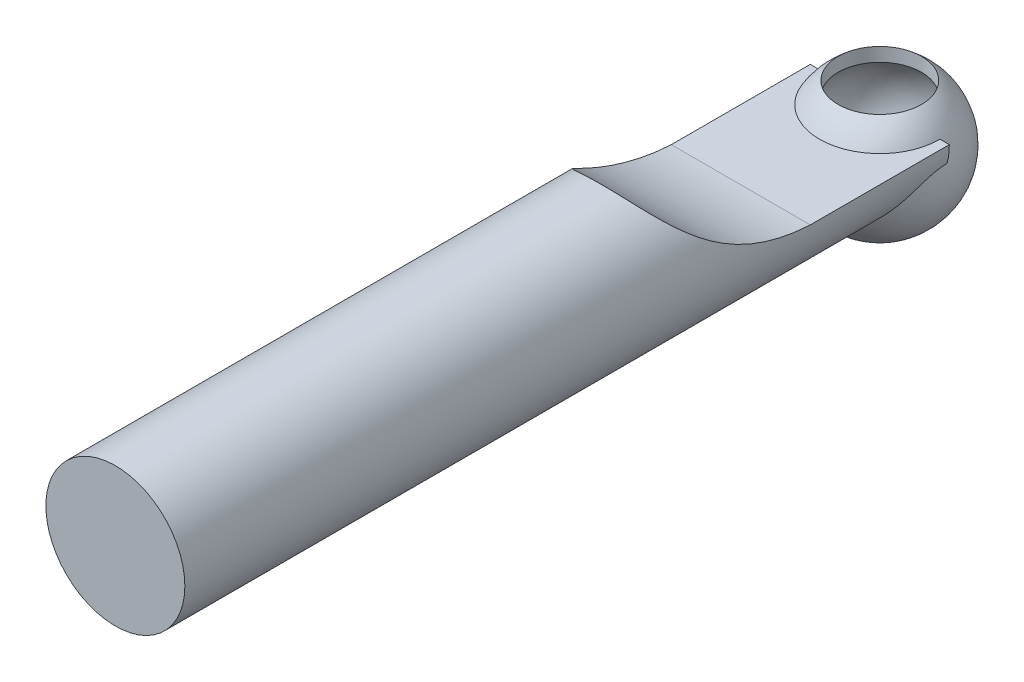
ISO-10303-21;
HEADER;
FILE_DESCRIPTION(('STEP AP214'),'2;1');
FILE_NAME('part.step','',(''),(''),'','','');
FILE_SCHEMA(('AUTOMOTIVE_DESIGN { 1 0 10303 214 1 1 1 1 }'));
ENDSEC;
DATA;
#1=APPLICATION_CONTEXT('core data for automotive mechanical design processes');
#2=APPLICATION_PROTOCOL_DEFINITION('international standard','automotive_design',2000,#1);
#3=PRODUCT_CONTEXT('',#1,'mechanical');
#4=PRODUCT('Part','Part','',(#3));
#5=PRODUCT_RELATED_PRODUCT_CATEGORY('part','',(#4));
#6=PRODUCT_DEFINITION_FORMATION('','',#4);
#7=PRODUCT_DEFINITION_CONTEXT('part definition',#1,'design');
#8=PRODUCT_DEFINITION('design','',#6,#7);
#9=PRODUCT_DEFINITION_SHAPE('','',#8);
#10=(LENGTH_UNIT() NAMED_UNIT(*) SI_UNIT(.MILLI.,.METRE.));
#11=(NAMED_UNIT(*) PLANE_ANGLE_UNIT() SI_UNIT($,.RADIAN.));
#12=(NAMED_UNIT(*) SI_UNIT($,.STERADIAN.) SOLID_ANGLE_UNIT());
#13=UNCERTAINTY_MEASURE_WITH_UNIT(LENGTH_MEASURE(1.E-05),#10,'distance_accuracy_value','');
#14=(GEOMETRIC_REPRESENTATION_CONTEXT(3) GLOBAL_UNCERTAINTY_ASSIGNED_CONTEXT((#13)) GLOBAL_UNIT_ASSIGNED_CONTEXT((#10,
#11,#12)) REPRESENTATION_CONTEXT('',''));
#15=CARTESIAN_POINT('',(0.,0.,0.));
#16=DIRECTION('',(0.,0.,1.));
#17=DIRECTION('',(1.,0.,0.));
#18=AXIS2_PLACEMENT_3D('',#15,#16,#17);
#19=CARTESIAN_POINT('',(0.,-55.,-60.));
#20=DIRECTION('',(0.,1.,0.));
#21=DIRECTION('',(0.,0.,1.));
#22=AXIS2_PLACEMENT_3D('',#19,#20,#21);
#23=CYLINDRICAL_SURFACE('',#22,6.00000000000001);
#24=CARTESIAN_POINT('',(0.,-13.,-60.));
#25=DIRECTION('',(0.,1.,0.));
#26=DIRECTION('',(0.,0.,1.));
#27=AXIS2_PLACEMENT_3D('',#24,#25,#26);
#28=CIRCLE('',#27,6.00000000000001);
#29=CARTESIAN_POINT('',(0.,-13.,-54.));
#30=VERTEX_POINT('',#29);
#31=EDGE_CURVE('E208',#30,#30,#28,.F.);
#32=ORIENTED_EDGE('',*,*,#31,.T.);
#33=EDGE_LOOP('',(#32));
#34=FACE_BOUND('',#33,.T.);
#35=CARTESIAN_POINT('',(0.,-11.0207972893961,-60.));
#36=DIRECTION('',(0.,1.,0.));
#37=DIRECTION('',(0.,0.,1.));
#38=AXIS2_PLACEMENT_3D('',#35,#36,#37);
#39=CIRCLE('',#38,6.00000000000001);
#40=CARTESIAN_POINT('',(0.,-11.0207972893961,-54.));
#41=VERTEX_POINT('',#40);
#42=EDGE_CURVE('E210',#41,#41,#39,.F.);
#43=ORIENTED_EDGE('',*,*,#42,.F.);
#44=EDGE_LOOP('',(#43));
#45=FACE_BOUND('',#44,.T.);
#46=ADVANCED_FACE('F39',(#34,#45),#23,.F.);
#47=CARTESIAN_POINT('',(0.,3.,-60.));
#48=DIRECTION('',(0.,-1.,0.));
#49=DIRECTION('',(0.,0.,-1.));
#50=AXIS2_PLACEMENT_3D('',#47,#48,#49);
#51=CIRCLE('',#50,6.00000000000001);
#52=CARTESIAN_POINT('',(0.,3.,-66.));
#53=VERTEX_POINT('',#52);
#54=EDGE_CURVE('E209',#53,#53,#51,.F.);
#55=ORIENTED_EDGE('',*,*,#54,.T.);
#56=EDGE_LOOP('',(#55));
#57=FACE_BOUND('',#56,.T.);
#58=CARTESIAN_POINT('',(0.,1.02079728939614,-60.));
#59=DIRECTION('',(0.,-1.,0.));
#60=DIRECTION('',(0.,0.,-1.));
#61=AXIS2_PLACEMENT_3D('',#58,#59,#60);
#62=CIRCLE('',#61,6.00000000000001);
#63=CARTESIAN_POINT('',(0.,1.02079728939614,-66.));
#64=VERTEX_POINT('',#63);
#65=EDGE_CURVE('E42',#64,#64,#62,.F.);
#66=ORIENTED_EDGE('',*,*,#65,.F.);
#67=EDGE_LOOP('',(#66));
#68=FACE_BOUND('',#67,.T.);
#69=ADVANCED_FACE('F128',(#57,#68),#23,.F.);
#70=CARTESIAN_POINT('',(0.,0.,-60.));
#71=DIRECTION('',(0.,0.,-1.));
#72=DIRECTION('',(-1.,0.,0.));
#73=AXIS2_PLACEMENT_3D('',#70,#71,#72);
#74=PLANE('',#73);
#75=CARTESIAN_POINT('',(0.,-5.,-60.));
#76=DIRECTION('',(0.,0.,-1.));
#77=DIRECTION('',(-1.,0.,0.));
#78=AXIS2_PLACEMENT_3D('',#75,#76,#77);
#79=CIRCLE('',#78,10.);
#80=CARTESIAN_POINT('',(-9.68245836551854,-2.5,-60.));
#81=VERTEX_POINT('',#80);
#82=CARTESIAN_POINT('',(-8.66025403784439,0.,-60.));
#83=VERTEX_POINT('',#82);
#84=EDGE_CURVE('E11',#81,#83,#79,.T.);
#85=ORIENTED_EDGE('',*,*,#84,.F.);
#86=CARTESIAN_POINT('',(0.,0.,-60.));
#87=DIRECTION('',(0.,0.,-1.));
#88=DIRECTION('',(-1.,0.,0.));
#89=AXIS2_PLACEMENT_3D('',#86,#87,#88);
#90=CIRCLE('',#89,10.);
#91=CARTESIAN_POINT('',(-10.,0.,-60.));
#92=VERTEX_POINT('',#91);
#93=EDGE_CURVE('E87',#81,#92,#90,.T.);
#94=ORIENTED_EDGE('',*,*,#93,.T.);
#95=DIRECTION('',(1.,0.,0.));
#96=VECTOR('',#95,1.);
#97=CARTESIAN_POINT('',(-10.,0.,-60.));
#98=LINE('',#97,#96);
#99=EDGE_CURVE('E151',#92,#83,#98,.T.);
#100=ORIENTED_EDGE('',*,*,#99,.T.);
#101=EDGE_LOOP('',(#85,#94,#100));
#102=FACE_BOUND('',#101,.T.);
#103=ADVANCED_FACE('F127',(#102),#74,.T.);
#104=CARTESIAN_POINT('',(0.,0.,50.));
#105=DIRECTION('',(0.,0.,-1.));
#106=DIRECTION('',(-1.,0.,0.));
#107=AXIS2_PLACEMENT_3D('',#104,#105,#106);
#108=CYLINDRICAL_SURFACE('',#107,10.);
#109=CARTESIAN_POINT('',(0.,0.,50.));
#110=DIRECTION('',(0.,0.,1.));
#111=DIRECTION('',(1.,0.,0.));
#112=AXIS2_PLACEMENT_3D('',#109,#110,#111);
#113=CIRCLE('',#112,10.);
#114=CARTESIAN_POINT('',(10.,0.,50.));
#115=VERTEX_POINT('',#114);
#116=EDGE_CURVE('E109',#115,#115,#113,.T.);
#117=ORIENTED_EDGE('',*,*,#116,.F.);
#118=EDGE_LOOP('',(#117));
#119=FACE_BOUND('',#118,.T.);
#120=ORIENTED_EDGE('',*,*,#93,.F.);
#121=CARTESIAN_POINT('',(-9.68245836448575,-2.500000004,-60.0002));
#122=CARTESIAN_POINT('',(-9.68245010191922,-2.49991985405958,-59.8515149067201));
#123=CARTESIAN_POINT('',(-9.68074927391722,-2.50661752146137,-59.7028662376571));
#124=CARTESIAN_POINT('',(-9.67389466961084,-2.53300126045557,-59.4069786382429));
#125=CARTESIAN_POINT('',(-9.6687450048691,-2.55267186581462,-59.2597382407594));
#126=CARTESIAN_POINT('',(-9.65500299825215,-2.60414539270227,-58.9692884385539));
#127=CARTESIAN_POINT('',(-9.64645005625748,-2.63580927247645,-58.826052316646));
#128=CARTESIAN_POINT('',(-9.62577377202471,-2.71034717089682,-58.5427637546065));
#129=CARTESIAN_POINT('',(-9.61364919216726,-2.7532250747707,-58.4027124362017));
#130=CARTESIAN_POINT('',(-9.58220511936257,-2.86098259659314,-58.0922447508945));
#131=CARTESIAN_POINT('',(-9.56184702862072,-2.92868145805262,-57.9229105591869));
#132=CARTESIAN_POINT('',(-9.51499190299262,-3.07750005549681,-57.5911524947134));
#133=CARTESIAN_POINT('',(-9.4884934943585,-3.15862279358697,-57.428730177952));
#134=CARTESIAN_POINT('',(-9.42887393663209,-3.33238711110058,-57.1104824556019));
#135=CARTESIAN_POINT('',(-9.39572304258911,-3.4250796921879,-56.9546906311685));
#136=CARTESIAN_POINT('',(-9.32253140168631,-3.61956015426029,-56.6505617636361));
#137=CARTESIAN_POINT('',(-9.28248851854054,-3.72135085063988,-56.5022270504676));
#138=CARTESIAN_POINT('',(-9.17807902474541,-3.97341472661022,-56.1562103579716));
#139=CARTESIAN_POINT('',(-9.11033152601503,-4.12704764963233,-55.9619861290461));
#140=CARTESIAN_POINT('',(-8.96016236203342,-4.44367289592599,-55.5873091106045));
#141=CARTESIAN_POINT('',(-8.87773534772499,-4.60666861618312,-55.4068613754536));
#142=CARTESIAN_POINT('',(-8.69770092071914,-4.93817501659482,-55.0591534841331));
#143=CARTESIAN_POINT('',(-8.6000951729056,-5.10668509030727,-54.8918918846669));
#144=CARTESIAN_POINT('',(-8.3893702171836,-5.44594802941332,-54.5699554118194));
#145=CARTESIAN_POINT('',(-8.27625262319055,-5.61670065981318,-54.4152792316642));
#146=CARTESIAN_POINT('',(-8.03145479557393,-5.96167157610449,-54.1144349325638));
#147=CARTESIAN_POINT('',(-7.89939581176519,-6.13587525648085,-53.9685581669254));
#148=CARTESIAN_POINT('',(-7.61889837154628,-6.48088128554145,-53.6890299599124));
#149=CARTESIAN_POINT('',(-7.47045952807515,-6.65168355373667,-53.5553788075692));
#150=CARTESIAN_POINT('',(-7.15749072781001,-6.98734395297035,-53.3000196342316));
#151=CARTESIAN_POINT('',(-6.99296233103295,-7.15220265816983,-53.1783104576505));
#152=CARTESIAN_POINT('',(-6.64829859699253,-7.47366484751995,-52.946627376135));
#153=CARTESIAN_POINT('',(-6.4681628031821,-7.6302680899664,-52.8366538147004));
#154=CARTESIAN_POINT('',(-6.0812465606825,-7.94254639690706,-52.6218080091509));
#155=CARTESIAN_POINT('',(-5.87350393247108,-8.09754899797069,-52.5176866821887));
#156=CARTESIAN_POINT('',(-5.44235019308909,-8.39340141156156,-52.3225307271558));
#157=CARTESIAN_POINT('',(-5.21893820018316,-8.53425042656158,-52.2314968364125));
#158=CARTESIAN_POINT('',(-4.75790536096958,-8.79960640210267,-52.0625445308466));
#159=CARTESIAN_POINT('',(-4.52028535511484,-8.92411432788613,-51.9846253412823));
#160=CARTESIAN_POINT('',(-4.03254833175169,-9.15485234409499,-51.841960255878));
#161=CARTESIAN_POINT('',(-3.78243229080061,-9.26108385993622,-51.7772133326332));
#162=CARTESIAN_POINT('',(-3.28834985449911,-9.44731947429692,-51.6647649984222));
#163=CARTESIAN_POINT('',(-3.04504775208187,-9.5285829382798,-51.6162268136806));
#164=CARTESIAN_POINT('',(-2.55102186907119,-9.67256298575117,-51.5307936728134));
#165=CARTESIAN_POINT('',(-2.30029837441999,-9.73528028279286,-51.4938982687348));
#166=CARTESIAN_POINT('',(-1.79342983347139,-9.84127174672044,-51.4318216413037));
#167=CARTESIAN_POINT('',(-1.5372864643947,-9.88455183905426,-51.406636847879));
#168=CARTESIAN_POINT('',(-1.02153712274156,-9.95108331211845,-51.3680125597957));
#169=CARTESIAN_POINT('',(-0.76193126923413,-9.97433537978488,-51.3545726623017));
#170=CARTESIAN_POINT('',(-0.255360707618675,-9.99978067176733,-51.3398698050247));
#171=CARTESIAN_POINT('',(-0.00846655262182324,-10.0030386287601,-51.3379911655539));
#172=CARTESIAN_POINT('',(0.484734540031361,-9.99128978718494,-51.3447755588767));
#173=CARTESIAN_POINT('',(0.731041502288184,-9.97628376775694,-51.3534381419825));
#174=CARTESIAN_POINT('',(1.22125200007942,-9.92820190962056,-51.3812870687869));
#175=CARTESIAN_POINT('',(1.46515582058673,-9.89512824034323,-51.4004721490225));
#176=CARTESIAN_POINT('',(1.94884505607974,-9.81133257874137,-51.4493320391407));
#177=CARTESIAN_POINT('',(2.18863044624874,-9.76061048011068,-51.4790069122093));
#178=CARTESIAN_POINT('',(2.66006064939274,-9.64274491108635,-51.5484532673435));
#179=CARTESIAN_POINT('',(2.89176251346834,-9.57576878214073,-51.5881220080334));
#180=CARTESIAN_POINT('',(3.34795397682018,-9.42596635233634,-51.6776405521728));
#181=CARTESIAN_POINT('',(3.57244367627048,-9.34314027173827,-51.7274902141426));
#182=CARTESIAN_POINT('',(4.01281240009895,-9.16263964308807,-51.8373158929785));
#183=CARTESIAN_POINT('',(4.22869115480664,-9.06496463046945,-51.8972922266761));
#184=CARTESIAN_POINT('',(4.65056403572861,-8.85594012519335,-52.0273199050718));
#185=CARTESIAN_POINT('',(4.85655791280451,-8.74459028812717,-52.0973715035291));
#186=CARTESIAN_POINT('',(5.26422137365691,-8.50562380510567,-52.2500156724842));
#187=CARTESIAN_POINT('',(5.46551843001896,-8.37758889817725,-52.3329482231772));
#188=CARTESIAN_POINT('',(5.85530813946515,-8.10994838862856,-52.5095207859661));
#189=CARTESIAN_POINT('',(6.04380054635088,-7.97034256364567,-52.6031610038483));
#190=CARTESIAN_POINT('',(6.40716603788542,-7.68128454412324,-52.8012046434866));
#191=CARTESIAN_POINT('',(6.58203560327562,-7.53182982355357,-52.9056108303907));
#192=CARTESIAN_POINT('',(6.91743561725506,-7.22500848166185,-53.1252529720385));
#193=CARTESIAN_POINT('',(7.07796574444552,-7.06764168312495,-53.2404891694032));
#194=CARTESIAN_POINT('',(7.39426571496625,-6.73651444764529,-53.4898768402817));
#195=CARTESIAN_POINT('',(7.54903214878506,-6.56235584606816,-53.6247732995));
#196=CARTESIAN_POINT('',(7.84142040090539,-6.21003509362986,-53.9073552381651));
#197=CARTESIAN_POINT('',(7.97904039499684,-6.03187251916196,-54.055042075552));
#198=CARTESIAN_POINT('',(8.23708158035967,-5.67442442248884,-54.3636825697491));
#199=CARTESIAN_POINT('',(8.35749589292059,-5.49513848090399,-54.5246414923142));
#200=CARTESIAN_POINT('',(8.58119115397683,-5.13881098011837,-54.8603225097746));
#201=CARTESIAN_POINT('',(8.68447541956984,-4.96176899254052,-55.0350419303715));
#202=CARTESIAN_POINT('',(8.85703270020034,-4.64535240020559,-55.36581592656));
#203=CARTESIAN_POINT('',(8.92907475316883,-4.50498533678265,-55.5194823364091));
#204=CARTESIAN_POINT('',(9.06228193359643,-4.23063625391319,-55.8368823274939));
#205=CARTESIAN_POINT('',(9.12344913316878,-4.09665302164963,-56.000613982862));
#206=CARTESIAN_POINT('',(9.23526744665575,-3.83792482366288,-56.3383445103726));
#207=CARTESIAN_POINT('',(9.28593137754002,-3.71316871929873,-56.5123305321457));
#208=CARTESIAN_POINT('',(9.37731633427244,-3.47593309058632,-56.8708699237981));
#209=CARTESIAN_POINT('',(9.41804143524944,-3.363448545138,-57.055418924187));
#210=CARTESIAN_POINT('',(9.50485548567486,-3.11157800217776,-57.5125916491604));
#211=CARTESIAN_POINT('',(9.54636847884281,-2.97990625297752,-57.7904623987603));
#212=CARTESIAN_POINT('',(9.61243751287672,-2.75944486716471,-58.3641473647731));
#213=CARTESIAN_POINT('',(9.63704617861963,-2.67052240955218,-58.6599027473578));
#214=CARTESIAN_POINT('',(9.66352351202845,-2.57246584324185,-59.1317650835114));
#215=CARTESIAN_POINT('',(9.67062754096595,-2.54545008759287,-59.3039509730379));
#216=CARTESIAN_POINT('',(9.6777294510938,-2.51826116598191,-59.5639370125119));
#217=CARTESIAN_POINT('',(9.67950437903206,-2.51142044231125,-59.651017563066));
#218=CARTESIAN_POINT('',(9.68186889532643,-2.50228327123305,-59.8254613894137));
#219=CARTESIAN_POINT('',(9.68245808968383,-2.49998833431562,-59.9128247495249));
#220=CARTESIAN_POINT('',(9.68245836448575,-2.500000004,-60.0002));
#221=B_SPLINE_CURVE_WITH_KNOTS('',3,(#121,#122,#123,#124,#125,#126,#127,#128,#129,#130,#131,
#132,#133,#134,#135,#136,#137,#138,#139,#140,#141,#142,#143,#144,#145,#146,#147,#148,#149,#150,
#151,#152,#153,#154,#155,#156,#157,#158,#159,#160,#161,#162,#163,#164,#165,#166,#167,#168,#169,
#170,#171,#172,#173,#174,#175,#176,#177,#178,#179,#180,#181,#182,#183,#184,#185,#186,#187,#188,
#189,#190,#191,#192,#193,#194,#195,#196,#197,#198,#199,#200,#201,#202,#203,#204,#205,#206,#207,
#208,#209,#210,#211,#212,#213,#214,#215,#216,#217,#218,#219,#220),.UNSPECIFIED.,.F.,.F.,(4,2,2,
2,2,2,2,2,2,2,2,2,2,2,2,2,2,2,2,2,2,2,2,2,2,2,2,2,2,2,2,2,2,2,2,2,2,2,2,2,2,2,2,2,2,2,2,2,2,4),
(0.,0.445835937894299,0.891141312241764,1.33143474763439,1.7718809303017,2.32154639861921,
2.87133496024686,3.42363885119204,3.97611424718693,4.74522743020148,5.51462144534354,
6.2839311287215,7.05316083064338,7.84075857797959,8.62837494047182,9.41591501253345,
10.2034781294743,11.0403683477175,11.8773056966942,12.7141935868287,13.5510161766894,
14.3332148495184,15.1153834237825,15.8973133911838,16.6792165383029,17.4190925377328,
18.1589369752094,18.8986925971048,19.6384526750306,20.370897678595,21.1033325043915,
21.8357902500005,22.5682664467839,23.3251383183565,24.0820247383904,24.8391060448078,
25.5962043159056,26.4029774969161,27.2098364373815,28.0170170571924,28.824041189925,
29.4842271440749,30.1442871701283,30.8035369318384,31.4625159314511,32.3900067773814,
33.3145970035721,33.8369648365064,34.0989484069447,34.3610190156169),.UNSPECIFIED.);
#222=CARTESIAN_POINT('',(9.68245836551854,-2.5,-60.));
#223=VERTEX_POINT('',#222);
#224=EDGE_CURVE('E93',#81,#223,#221,.T.);
#225=ORIENTED_EDGE('',*,*,#224,.T.);
#226=CARTESIAN_POINT('',(10.,0.,-60.));
#227=VERTEX_POINT('',#226);
#228=EDGE_CURVE('E79',#227,#223,#90,.T.);
#229=ORIENTED_EDGE('',*,*,#228,.F.);
#230=DIRECTION('',(0.,0.,-1.));
#231=VECTOR('',#230,1.);
#232=CARTESIAN_POINT('',(10.,0.,50.));
#233=LINE('',#232,#231);
#234=CARTESIAN_POINT('',(10.,0.,-40.));
#235=VERTEX_POINT('',#234);
#236=EDGE_CURVE('E100',#227,#235,#233,.F.);
#237=ORIENTED_EDGE('',*,*,#236,.T.);
#238=CARTESIAN_POINT('',(10.,0.,-40.));
#239=CARTESIAN_POINT('',(9.99995835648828,0.0198647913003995,-39.6123136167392));
#240=CARTESIAN_POINT('',(9.99993939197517,0.0478332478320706,-39.2250423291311));
#241=CARTESIAN_POINT('',(9.99935717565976,0.119907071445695,-38.4519962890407));
#242=CARTESIAN_POINT('',(9.99879391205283,0.164012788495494,-38.0662215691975));
#243=CARTESIAN_POINT('',(9.99653202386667,0.26835346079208,-37.2963825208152));
#244=CARTESIAN_POINT('',(9.99483201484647,0.32860803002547,-36.9123208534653));
#245=CARTESIAN_POINT('',(9.98941199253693,0.465111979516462,-36.1470677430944));
#246=CARTESIAN_POINT('',(9.98569200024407,0.541361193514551,-35.7658762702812));
#247=CARTESIAN_POINT('',(9.97508750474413,0.710550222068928,-35.0032823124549));
#248=CARTESIAN_POINT('',(9.96817194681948,0.80364824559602,-34.6219153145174));
#249=CARTESIAN_POINT('',(9.94980503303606,1.00582489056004,-33.8635530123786));
#250=CARTESIAN_POINT('',(9.93835374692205,1.11490326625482,-33.4865576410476));
#251=CARTESIAN_POINT('',(9.90933046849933,1.34871831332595,-32.7379633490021));
#252=CARTESIAN_POINT('',(9.89176264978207,1.47344427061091,-32.3663609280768));
#253=CARTESIAN_POINT('',(9.84867575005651,1.73826738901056,-31.6291874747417));
#254=CARTESIAN_POINT('',(9.82315758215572,1.87836278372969,-31.2636157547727));
#255=CARTESIAN_POINT('',(9.75511118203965,2.20729506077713,-30.4564808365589));
#256=CARTESIAN_POINT('',(9.71002658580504,2.399949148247,-30.0166737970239));
#257=CARTESIAN_POINT('',(9.60035652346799,2.80669124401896,-29.1495241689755));
#258=CARTESIAN_POINT('',(9.53577121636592,3.02077907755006,-28.7221814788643));
#259=CARTESIAN_POINT('',(9.38241747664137,3.46783689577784,-27.8839321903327));
#260=CARTESIAN_POINT('',(9.29373852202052,3.70073481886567,-27.4729711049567));
#261=CARTESIAN_POINT('',(9.08665437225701,4.18349989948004,-26.668877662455));
#262=CARTESIAN_POINT('',(8.96825911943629,4.43336136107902,-26.2757393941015));
#263=CARTESIAN_POINT('',(8.73434146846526,4.87387666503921,-25.6188075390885));
#264=CARTESIAN_POINT('',(8.62742757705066,5.06135274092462,-25.3498075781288));
#265=CARTESIAN_POINT('',(8.39308758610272,5.44112618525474,-24.8244687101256));
#266=CARTESIAN_POINT('',(8.26566692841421,5.63342226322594,-24.5681264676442));
#267=CARTESIAN_POINT('',(7.9883000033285,6.02027067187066,-24.0700363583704));
#268=CARTESIAN_POINT('',(7.83837131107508,6.2148211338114,-23.8282773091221));
#269=CARTESIAN_POINT('',(7.51405746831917,6.60324933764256,-23.3611501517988));
#270=CARTESIAN_POINT('',(7.33967837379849,6.79712723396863,-23.1357780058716));
#271=CARTESIAN_POINT('',(7.00635725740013,7.1382503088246,-22.751179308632));
#272=CARTESIAN_POINT('',(6.85247991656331,7.28635780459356,-22.5883200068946));
#273=CARTESIAN_POINT('',(6.52863883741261,7.57788320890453,-22.2748947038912));
#274=CARTESIAN_POINT('',(6.35867902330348,7.72130225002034,-22.1243257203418));
#275=CARTESIAN_POINT('',(6.00256865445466,8.00127883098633,-21.8364766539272));
#276=CARTESIAN_POINT('',(5.81641778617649,8.13783623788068,-21.6991968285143));
#277=CARTESIAN_POINT('',(5.4282329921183,8.40174745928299,-21.4389141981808));
#278=CARTESIAN_POINT('',(5.2261988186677,8.52910113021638,-21.3159116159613));
#279=CARTESIAN_POINT('',(4.80524329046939,8.77321585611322,-21.0841361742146));
#280=CARTESIAN_POINT('',(4.5861951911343,8.88987974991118,-20.9754904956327));
#281=CARTESIAN_POINT('',(4.13393347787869,9.10899121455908,-20.7744675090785));
#282=CARTESIAN_POINT('',(3.90071945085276,9.21143837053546,-20.6820906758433));
#283=CARTESIAN_POINT('',(3.42196106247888,9.39980420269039,-20.5143406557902));
#284=CARTESIAN_POINT('',(3.17642305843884,9.48573129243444,-20.4389588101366));
#285=CARTESIAN_POINT('',(2.67505674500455,9.63912646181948,-20.3056877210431));
#286=CARTESIAN_POINT('',(2.41923010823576,9.70659752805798,-20.2477956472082));
#287=CARTESIAN_POINT('',(1.93533884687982,9.81362384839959,-20.1565881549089));
#288=CARTESIAN_POINT('',(1.70826339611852,9.85573518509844,-20.1209941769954));
#289=CARTESIAN_POINT('',(1.2500731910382,9.92426088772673,-20.063292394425));
#290=CARTESIAN_POINT('',(1.01895884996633,9.95067684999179,-20.041183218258));
#291=CARTESIAN_POINT('',(0.554642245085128,9.98732153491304,-20.0105577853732));
#292=CARTESIAN_POINT('',(0.321440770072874,9.99755613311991,-20.0020365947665));
#293=CARTESIAN_POINT('',(-0.145205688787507,10.0016673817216,-19.9986104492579));
#294=CARTESIAN_POINT('',(-0.378650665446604,9.99554450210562,-20.0037051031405));
#295=CARTESIAN_POINT('',(-0.827807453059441,9.96804020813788,-20.0266653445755));
#296=CARTESIAN_POINT('',(-1.04363306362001,9.94773895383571,-20.0436270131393));
#297=CARTESIAN_POINT('',(-1.47228028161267,9.8933845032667,-20.0892627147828));
#298=CARTESIAN_POINT('',(-1.68510207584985,9.85933216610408,-20.1179360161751));
#299=CARTESIAN_POINT('',(-2.10625261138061,9.77802075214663,-20.1868701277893));
#300=CARTESIAN_POINT('',(-2.31458213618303,9.73076399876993,-20.2271288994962));
#301=CARTESIAN_POINT('',(-2.72543522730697,9.62377616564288,-20.3190634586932));
#302=CARTESIAN_POINT('',(-2.92795864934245,9.56404477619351,-20.3707395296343));
#303=CARTESIAN_POINT('',(-3.32825558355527,9.43226510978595,-20.4859346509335));
#304=CARTESIAN_POINT('',(-3.52594788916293,9.36008332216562,-20.5495828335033));
#305=CARTESIAN_POINT('',(-3.91303024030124,9.20498076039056,-20.6880187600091));
#306=CARTESIAN_POINT('',(-4.10242031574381,9.12206002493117,-20.7628064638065));
#307=CARTESIAN_POINT('',(-4.47198454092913,8.94668595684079,-20.9231545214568));
#308=CARTESIAN_POINT('',(-4.65215882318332,8.85423276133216,-21.0087147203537));
#309=CARTESIAN_POINT('',(-5.00264444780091,8.66103982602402,-21.1902130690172));
#310=CARTESIAN_POINT('',(-5.1729521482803,8.56029705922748,-21.2861550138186));
#311=CARTESIAN_POINT('',(-5.51676074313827,8.34326166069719,-21.4962449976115));
#312=CARTESIAN_POINT('',(-5.68936557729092,8.22637186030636,-21.6112420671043));
#313=CARTESIAN_POINT('',(-6.02202659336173,7.986070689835,-21.8521911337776));
#314=CARTESIAN_POINT('',(-6.18207776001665,7.86265674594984,-21.9781474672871));
#315=CARTESIAN_POINT('',(-6.48945211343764,7.61094434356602,-22.2402852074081));
#316=CARTESIAN_POINT('',(-6.63677473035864,7.48264566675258,-22.3764670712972));
#317=CARTESIAN_POINT('',(-6.91881472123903,7.22265931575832,-22.6583442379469));
#318=CARTESIAN_POINT('',(-7.05352934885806,7.09097091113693,-22.8040416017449));
#319=CARTESIAN_POINT('',(-7.37661406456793,6.75749250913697,-23.1812768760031));
#320=CARTESIAN_POINT('',(-7.55704883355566,6.55440274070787,-23.4185020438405));
#321=CARTESIAN_POINT('',(-7.89135372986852,6.14783557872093,-23.9106895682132));
#322=CARTESIAN_POINT('',(-8.0452127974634,5.94435805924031,-24.1656592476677));
#323=CARTESIAN_POINT('',(-8.32872840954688,5.5401554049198,-24.6914525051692));
#324=CARTESIAN_POINT('',(-8.45834718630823,5.33943500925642,-24.9622999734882));
#325=CARTESIAN_POINT('',(-8.69556264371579,4.94372489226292,-25.5175277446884));
#326=CARTESIAN_POINT('',(-8.80315211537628,4.74873706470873,-25.8019124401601));
#327=CARTESIAN_POINT('',(-9.04786415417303,4.27084608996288,-26.5279472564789));
#328=CARTESIAN_POINT('',(-9.17276174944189,3.99286145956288,-26.9769804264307));
#329=CARTESIAN_POINT('',(-9.3868808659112,3.45963248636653,-27.8965630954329));
#330=CARTESIAN_POINT('',(-9.47608377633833,3.20440006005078,-28.3671236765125));
#331=CARTESIAN_POINT('',(-9.62661353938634,2.71902428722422,-29.3274800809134));
#332=CARTESIAN_POINT('',(-9.68783448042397,2.48897872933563,-29.8173414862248));
#333=CARTESIAN_POINT('',(-9.78863404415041,2.05713761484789,-30.811417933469));
#334=CARTESIAN_POINT('',(-9.82821449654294,1.85533967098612,-31.3156317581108));
#335=CARTESIAN_POINT('',(-9.88024431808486,1.5477875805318,-32.1543904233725));
#336=CARTESIAN_POINT('',(-9.89733659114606,1.43339354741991,-32.4855282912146));
#337=CARTESIAN_POINT('',(-9.92625853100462,1.21709252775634,-33.1521113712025));
#338=CARTESIAN_POINT('',(-9.9380879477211,1.11518613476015,-33.4875567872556));
#339=CARTESIAN_POINT('',(-9.95767985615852,0.924035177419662,-34.1622625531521));
#340=CARTESIAN_POINT('',(-9.96544102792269,0.834794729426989,-34.5015241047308));
#341=CARTESIAN_POINT('',(-9.97793164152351,0.669162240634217,-35.1832253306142));
#342=CARTESIAN_POINT('',(-9.98266106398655,0.592770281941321,-35.5256650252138));
#343=CARTESIAN_POINT('',(-9.98994590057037,0.453638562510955,-36.2098422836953));
#344=CARTESIAN_POINT('',(-9.9925221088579,0.390772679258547,-36.5515540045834));
#345=CARTESIAN_POINT('',(-9.9962984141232,0.27784836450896,-37.2370955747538));
#346=CARTESIAN_POINT('',(-9.99749850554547,0.227789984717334,-37.5809254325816));
#347=CARTESIAN_POINT('',(-9.99910879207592,0.140580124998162,-38.2700033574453));
#348=CARTESIAN_POINT('',(-9.99951947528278,0.103420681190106,-38.6152504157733));
#349=CARTESIAN_POINT('',(-9.9999517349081,0.0420142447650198,-39.3068876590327));
#350=CARTESIAN_POINT('',(-9.99997331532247,0.0177671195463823,-39.6532778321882));
#351=CARTESIAN_POINT('',(-10.,0.,-40.));
#352=B_SPLINE_CURVE_WITH_KNOTS('',3,(#238,#239,#240,#241,#242,#243,#244,#245,#246,#247,#248,
#249,#250,#251,#252,#253,#254,#255,#256,#257,#258,#259,#260,#261,#262,#263,#264,#265,#266,#267,
#268,#269,#270,#271,#272,#273,#274,#275,#276,#277,#278,#279,#280,#281,#282,#283,#284,#285,#286,
#287,#288,#289,#290,#291,#292,#293,#294,#295,#296,#297,#298,#299,#300,#301,#302,#303,#304,#305,
#306,#307,#308,#309,#310,#311,#312,#313,#314,#315,#316,#317,#318,#319,#320,#321,#322,#323,#324,
#325,#326,#327,#328,#329,#330,#331,#332,#333,#334,#335,#336,#337,#338,#339,#340,#341,#342,#343,
#344,#345,#346,#347,#348,#349,#350,#351),.UNSPECIFIED.,.F.,.F.,(4,2,2,2,2,2,2,2,2,2,2,2,2,2,2,2,
2,2,2,2,2,2,2,2,2,2,2,2,2,2,2,2,2,2,2,2,2,2,2,2,2,2,2,2,2,2,2,2,2,2,2,2,2,2,2,2,4),(0.,
1.16450071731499,2.32902669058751,3.49497352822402,4.66090824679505,5.8384199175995,
7.01591348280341,8.19260515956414,9.3691617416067,10.8149857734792,12.2607980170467,
13.7013125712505,15.1413458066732,16.1752133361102,17.2088069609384,18.241597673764,
19.2741330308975,20.0791590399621,20.8839891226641,21.6888347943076,22.493693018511,
23.3052612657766,24.1168531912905,24.9280306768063,25.7390768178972,26.4391830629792,
27.1392180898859,27.8389988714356,28.5387595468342,29.1903162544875,29.8418322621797,
30.4932337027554,31.1446513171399,31.8035463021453,32.4624389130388,33.1213220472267,
33.7804468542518,34.4939585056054,35.2077537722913,35.9215809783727,36.6355633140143,
37.715884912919,38.796655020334,39.8790952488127,40.9618891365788,42.587383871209,
44.2137250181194,45.8461718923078,47.4784807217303,48.5304896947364,49.5825486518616,
50.6349487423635,51.687355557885,52.7294775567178,53.7716037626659,54.8130854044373,
55.8545563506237),.UNSPECIFIED.);
#353=CARTESIAN_POINT('',(-10.,0.,-40.));
#354=VERTEX_POINT('',#353);
#355=EDGE_CURVE('E105',#235,#354,#352,.T.);
#356=ORIENTED_EDGE('',*,*,#355,.T.);
#357=DIRECTION('',(0.,0.,-1.));
#358=VECTOR('',#357,1.);
#359=CARTESIAN_POINT('',(-10.,0.,50.));
#360=LINE('',#359,#358);
#361=EDGE_CURVE('E98',#354,#92,#360,.T.);
#362=ORIENTED_EDGE('',*,*,#361,.T.);
#363=EDGE_LOOP('',(#120,#225,#229,#237,#356,#362));
#364=FACE_BOUND('',#363,.T.);
#365=ADVANCED_FACE('F41',(#119,#364),#108,.T.);
#366=CARTESIAN_POINT('',(0.,0.,50.));
#367=DIRECTION('',(0.,0.,1.));
#368=DIRECTION('',(1.,0.,0.));
#369=AXIS2_PLACEMENT_3D('',#366,#367,#368);
#370=PLANE('',#369);
#371=ORIENTED_EDGE('',*,*,#116,.T.);
#372=EDGE_LOOP('',(#371));
#373=FACE_BOUND('',#372,.T.);
#374=ADVANCED_FACE('F118',(#373),#370,.T.);
#375=CARTESIAN_POINT('',(-50.,0.,-50.));
#376=DIRECTION('',(0.,-1.,0.));
#377=DIRECTION('',(0.,0.,-1.));
#378=AXIS2_PLACEMENT_3D('',#375,#376,#377);
#379=PLANE('',#378);
#380=CARTESIAN_POINT('',(8.66025403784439,0.,-60.));
#381=VERTEX_POINT('',#380);
#382=EDGE_CURVE('E81',#381,#227,#98,.T.);
#383=ORIENTED_EDGE('',*,*,#382,.F.);
#384=CARTESIAN_POINT('',(0.,0.,-60.));
#385=DIRECTION('',(0.,-1.,0.));
#386=DIRECTION('',(0.,0.,-1.));
#387=AXIS2_PLACEMENT_3D('',#384,#385,#386);
#388=CIRCLE('',#387,8.66025403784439);
#389=EDGE_CURVE('E65',#381,#83,#388,.T.);
#390=ORIENTED_EDGE('',*,*,#389,.T.);
#391=ORIENTED_EDGE('',*,*,#99,.F.);
#392=ORIENTED_EDGE('',*,*,#361,.F.);
#393=DIRECTION('',(1.,0.,0.));
#394=VECTOR('',#393,1.);
#395=CARTESIAN_POINT('',(-50.,0.,-40.));
#396=LINE('',#395,#394);
#397=EDGE_CURVE('E155',#354,#235,#396,.T.);
#398=ORIENTED_EDGE('',*,*,#397,.T.);
#399=ORIENTED_EDGE('',*,*,#236,.F.);
#400=EDGE_LOOP('',(#383,#390,#391,#392,#398,#399));
#401=FACE_BOUND('',#400,.T.);
#402=ADVANCED_FACE('F116',(#401),#379,.F.);
#403=CARTESIAN_POINT('',(-50.,27.8553095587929,-41.4276547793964));
#404=DIRECTION('',(1.,0.,0.));
#405=DIRECTION('',(0.,0.,-1.));
#406=AXIS2_PLACEMENT_3D('',#403,#404,#405);
#407=CYLINDRICAL_SURFACE('',#406,27.8918710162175);
#408=ORIENTED_EDGE('',*,*,#397,.F.);
#409=ORIENTED_EDGE('',*,*,#355,.F.);
#410=EDGE_LOOP('',(#408,#409));
#411=FACE_BOUND('',#410,.T.);
#412=ADVANCED_FACE('F115',(#411),#407,.F.);
#413=EDGE_CURVE('E47',#381,#223,#79,.T.);
#414=ORIENTED_EDGE('',*,*,#413,.F.);
#415=ORIENTED_EDGE('',*,*,#382,.T.);
#416=ORIENTED_EDGE('',*,*,#228,.T.);
#417=EDGE_LOOP('',(#414,#415,#416));
#418=FACE_BOUND('',#417,.T.);
#419=ADVANCED_FACE('F85',(#418),#74,.T.);
#420=CARTESIAN_POINT('',(0.,-5.,-60.));
#421=DIRECTION('',(0.,0.,1.));
#422=DIRECTION('',(-1.,0.,0.));
#423=AXIS2_PLACEMENT_3D('',#420,#421,#422);
#424=SPHERICAL_SURFACE('',#423,10.);
#425=ORIENTED_EDGE('',*,*,#224,.F.);
#426=ORIENTED_EDGE('',*,*,#84,.T.);
#427=ORIENTED_EDGE('',*,*,#389,.F.);
#428=ORIENTED_EDGE('',*,*,#413,.T.);
#429=EDGE_LOOP('',(#425,#426,#427,#428));
#430=FACE_BOUND('',#429,.T.);
#431=ORIENTED_EDGE('',*,*,#54,.F.);
#432=EDGE_LOOP('',(#431));
#433=FACE_BOUND('',#432,.T.);
#434=ORIENTED_EDGE('',*,*,#31,.F.);
#435=EDGE_LOOP('',(#434));
#436=FACE_BOUND('',#435,.T.);
#437=ADVANCED_FACE('F92',(#430,#433,#436),#424,.T.);
#438=CARTESIAN_POINT('',(0.,-5.,-60.));
#439=DIRECTION('',(0.,0.,-1.));
#440=DIRECTION('',(1.,0.,0.));
#441=AXIS2_PLACEMENT_3D('',#438,#439,#440);
#442=SPHERICAL_SURFACE('',#441,8.5);
#443=CARTESIAN_POINT('',(0.,-5.,-60.));
#444=DIRECTION('',(0.,-1.,0.));
#445=DIRECTION('',(0.,0.,-1.));
#446=AXIS2_PLACEMENT_3D('',#443,#444,#445);
#447=SPHERICAL_SURFACE('',#446,8.5);
#448=ORIENTED_EDGE('',*,*,#65,.T.);
#449=EDGE_LOOP('',(#448));
#450=FACE_BOUND('',#449,.T.);
#451=ORIENTED_EDGE('',*,*,#42,.T.);
#452=EDGE_LOOP('',(#451));
#453=FACE_BOUND('',#452,.T.);
#454=ADVANCED_FACE('F142',(#450,#453),#447,.F.);
#455=CLOSED_SHELL('',(#46,#69,#103,#365,#374,#402,#412,#419,#437,#454));
#456=MANIFOLD_SOLID_BREP('B2',#455);
#457=ADVANCED_BREP_SHAPE_REPRESENTATION('',(#18,#456),#14);
#458=SHAPE_DEFINITION_REPRESENTATION(#9,#457);
ENDSEC;
END-ISO-10303-21;
